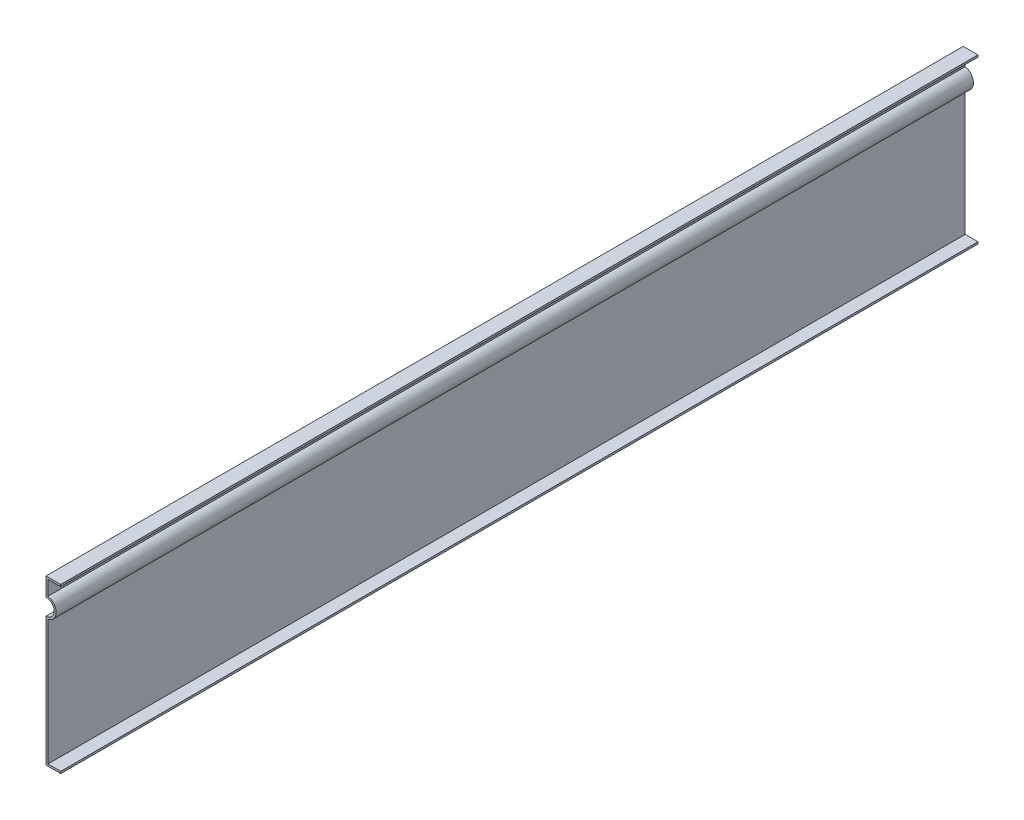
ISO-10303-21;
HEADER;
FILE_DESCRIPTION(('STEP AP214'),'2;1');
FILE_NAME('part.step','',(''),(''),'','','');
FILE_SCHEMA(('AUTOMOTIVE_DESIGN { 1 0 10303 214 1 1 1 1 }'));
ENDSEC;
DATA;
#1=APPLICATION_CONTEXT('core data for automotive mechanical design processes');
#2=APPLICATION_PROTOCOL_DEFINITION('international standard','automotive_design',2000,#1);
#3=PRODUCT_CONTEXT('',#1,'mechanical');
#4=PRODUCT('Part','Part','',(#3));
#5=PRODUCT_RELATED_PRODUCT_CATEGORY('part','',(#4));
#6=PRODUCT_DEFINITION_FORMATION('','',#4);
#7=PRODUCT_DEFINITION_CONTEXT('part definition',#1,'design');
#8=PRODUCT_DEFINITION('design','',#6,#7);
#9=PRODUCT_DEFINITION_SHAPE('','',#8);
#10=(LENGTH_UNIT() NAMED_UNIT(*) SI_UNIT(.MILLI.,.METRE.));
#11=(NAMED_UNIT(*) PLANE_ANGLE_UNIT() SI_UNIT($,.RADIAN.));
#12=(NAMED_UNIT(*) SI_UNIT($,.STERADIAN.) SOLID_ANGLE_UNIT());
#13=UNCERTAINTY_MEASURE_WITH_UNIT(LENGTH_MEASURE(1.E-05),#10,'distance_accuracy_value','');
#14=(GEOMETRIC_REPRESENTATION_CONTEXT(3) GLOBAL_UNCERTAINTY_ASSIGNED_CONTEXT((#13)) GLOBAL_UNIT_ASSIGNED_CONTEXT((#10,
#11,#12)) REPRESENTATION_CONTEXT('',''));
#15=CARTESIAN_POINT('',(0.,0.,0.));
#16=DIRECTION('',(0.,0.,1.));
#17=DIRECTION('',(1.,0.,0.));
#18=AXIS2_PLACEMENT_3D('',#15,#16,#17);
#19=CARTESIAN_POINT('',(0.,-1.214,560.));
#20=DIRECTION('',(-1.,0.,0.));
#21=DIRECTION('',(0.,0.,1.));
#22=AXIS2_PLACEMENT_3D('',#19,#20,#21);
#23=PLANE('',#22);
#24=DIRECTION('',(0.,1.,0.));
#25=VECTOR('',#24,1.);
#26=CARTESIAN_POINT('',(0.,-1.214,0.));
#27=LINE('',#26,#25);
#28=CARTESIAN_POINT('',(0.,-1.214,0.));
#29=VERTEX_POINT('',#28);
#30=CARTESIAN_POINT('',(0.,0.,0.));
#31=VERTEX_POINT('',#30);
#32=EDGE_CURVE('E150',#29,#31,#27,.T.);
#33=ORIENTED_EDGE('',*,*,#32,.T.);
#34=DIRECTION('',(0.,0.,-1.));
#35=VECTOR('',#34,1.);
#36=CARTESIAN_POINT('',(0.,0.,560.));
#37=LINE('',#36,#35);
#38=CARTESIAN_POINT('',(0.,0.,560.));
#39=VERTEX_POINT('',#38);
#40=EDGE_CURVE('E11',#39,#31,#37,.T.);
#41=ORIENTED_EDGE('',*,*,#40,.F.);
#42=DIRECTION('',(0.,1.,0.));
#43=VECTOR('',#42,1.);
#44=CARTESIAN_POINT('',(0.,-1.214,560.));
#45=LINE('',#44,#43);
#46=CARTESIAN_POINT('',(0.,-1.214,560.));
#47=VERTEX_POINT('',#46);
#48=EDGE_CURVE('E172',#47,#39,#45,.T.);
#49=ORIENTED_EDGE('',*,*,#48,.F.);
#50=DIRECTION('',(0.,0.,-1.));
#51=VECTOR('',#50,1.);
#52=CARTESIAN_POINT('',(0.,-1.214,560.));
#53=LINE('',#52,#51);
#54=EDGE_CURVE('E146',#47,#29,#53,.T.);
#55=ORIENTED_EDGE('',*,*,#54,.T.);
#56=EDGE_LOOP('',(#33,#41,#49,#55));
#57=FACE_BOUND('',#56,.T.);
#58=ADVANCED_FACE('F30',(#57),#23,.F.);
#59=CARTESIAN_POINT('',(0.,0.,560.));
#60=DIRECTION('',(0.,-1.,0.));
#61=DIRECTION('',(1.,0.,0.));
#62=AXIS2_PLACEMENT_3D('',#59,#60,#61);
#63=PLANE('',#62);
#64=DIRECTION('',(-1.,0.,0.));
#65=VECTOR('',#64,1.);
#66=CARTESIAN_POINT('',(0.,0.,0.));
#67=LINE('',#66,#65);
#68=CARTESIAN_POINT('',(-7.78599999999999,0.,0.));
#69=VERTEX_POINT('',#68);
#70=EDGE_CURVE('E153',#31,#69,#67,.T.);
#71=ORIENTED_EDGE('',*,*,#70,.T.);
#72=DIRECTION('',(0.,0.,-1.));
#73=VECTOR('',#72,1.);
#74=CARTESIAN_POINT('',(-7.78599999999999,0.,560.));
#75=LINE('',#74,#73);
#76=CARTESIAN_POINT('',(-7.78599999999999,0.,560.));
#77=VERTEX_POINT('',#76);
#78=EDGE_CURVE('E38',#77,#69,#75,.T.);
#79=ORIENTED_EDGE('',*,*,#78,.F.);
#80=DIRECTION('',(-1.,0.,0.));
#81=VECTOR('',#80,1.);
#82=CARTESIAN_POINT('',(0.,0.,560.));
#83=LINE('',#82,#81);
#84=EDGE_CURVE('E101',#39,#77,#83,.T.);
#85=ORIENTED_EDGE('',*,*,#84,.F.);
#86=ORIENTED_EDGE('',*,*,#40,.T.);
#87=EDGE_LOOP('',(#71,#79,#85,#86));
#88=FACE_BOUND('',#87,.T.);
#89=ADVANCED_FACE('F250',(#88),#63,.F.);
#90=CARTESIAN_POINT('',(-7.78599999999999,0.,560.));
#91=DIRECTION('',(-1.,0.,0.));
#92=DIRECTION('',(0.,-1.,0.));
#93=AXIS2_PLACEMENT_3D('',#90,#91,#92);
#94=PLANE('',#93);
#95=DIRECTION('',(0.,1.,0.));
#96=VECTOR('',#95,1.);
#97=CARTESIAN_POINT('',(-7.78599999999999,0.,0.));
#98=LINE('',#97,#96);
#99=CARTESIAN_POINT('',(-7.78599999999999,76.477740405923,0.));
#100=VERTEX_POINT('',#99);
#101=EDGE_CURVE('E155',#69,#100,#98,.T.);
#102=ORIENTED_EDGE('',*,*,#101,.T.);
#103=DIRECTION('',(0.,0.,-1.));
#104=VECTOR('',#103,1.);
#105=CARTESIAN_POINT('',(-7.78599999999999,76.477740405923,560.));
#106=LINE('',#105,#104);
#107=CARTESIAN_POINT('',(-7.78599999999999,76.477740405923,560.));
#108=VERTEX_POINT('',#107);
#109=EDGE_CURVE('E191',#108,#100,#106,.T.);
#110=ORIENTED_EDGE('',*,*,#109,.F.);
#111=DIRECTION('',(0.,1.,0.));
#112=VECTOR('',#111,1.);
#113=CARTESIAN_POINT('',(-7.78599999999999,0.,560.));
#114=LINE('',#113,#112);
#115=EDGE_CURVE('E199',#77,#108,#114,.T.);
#116=ORIENTED_EDGE('',*,*,#115,.F.);
#117=ORIENTED_EDGE('',*,*,#78,.T.);
#118=EDGE_LOOP('',(#102,#110,#116,#117));
#119=FACE_BOUND('',#118,.T.);
#120=ADVANCED_FACE('F197',(#119),#94,.F.);
#121=CARTESIAN_POINT('',(-9.,82.572,560.));
#122=DIRECTION('',(0.,0.,-1.));
#123=DIRECTION('',(-1.,0.,0.));
#124=AXIS2_PLACEMENT_3D('',#121,#122,#123);
#125=CYLINDRICAL_SURFACE('',#124,6.21399999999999);
#126=CARTESIAN_POINT('',(-9.,82.572,0.));
#127=DIRECTION('',(0.,0.,1.));
#128=DIRECTION('',(-1.,0.,0.));
#129=AXIS2_PLACEMENT_3D('',#126,#127,#128);
#130=CIRCLE('',#129,6.21399999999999);
#131=CARTESIAN_POINT('',(-7.78599999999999,88.666259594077,0.));
#132=VERTEX_POINT('',#131);
#133=EDGE_CURVE('E157',#100,#132,#130,.T.);
#134=ORIENTED_EDGE('',*,*,#133,.T.);
#135=DIRECTION('',(0.,0.,-1.));
#136=VECTOR('',#135,1.);
#137=CARTESIAN_POINT('',(-7.78599999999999,88.666259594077,560.));
#138=LINE('',#137,#136);
#139=CARTESIAN_POINT('',(-7.78599999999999,88.666259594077,560.));
#140=VERTEX_POINT('',#139);
#141=EDGE_CURVE('E188',#140,#132,#138,.T.);
#142=ORIENTED_EDGE('',*,*,#141,.F.);
#143=CARTESIAN_POINT('',(-9.,82.572,560.));
#144=DIRECTION('',(0.,0.,1.));
#145=DIRECTION('',(-1.,0.,0.));
#146=AXIS2_PLACEMENT_3D('',#143,#144,#145);
#147=CIRCLE('',#146,6.21399999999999);
#148=EDGE_CURVE('E217',#108,#140,#147,.T.);
#149=ORIENTED_EDGE('',*,*,#148,.F.);
#150=ORIENTED_EDGE('',*,*,#109,.T.);
#151=EDGE_LOOP('',(#134,#142,#149,#150));
#152=FACE_BOUND('',#151,.T.);
#153=ADVANCED_FACE('F208',(#152),#125,.T.);
#154=CARTESIAN_POINT('',(-7.78599999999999,88.666259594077,560.));
#155=DIRECTION('',(-1.,0.,0.));
#156=DIRECTION('',(0.,-1.,0.));
#157=AXIS2_PLACEMENT_3D('',#154,#155,#156);
#158=PLANE('',#157);
#159=DIRECTION('',(0.,1.,0.));
#160=VECTOR('',#159,1.);
#161=CARTESIAN_POINT('',(-7.78599999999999,88.666259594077,0.));
#162=LINE('',#161,#160);
#163=CARTESIAN_POINT('',(-7.78599999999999,97.572,0.));
#164=VERTEX_POINT('',#163);
#165=EDGE_CURVE('E159',#132,#164,#162,.T.);
#166=ORIENTED_EDGE('',*,*,#165,.T.);
#167=DIRECTION('',(0.,0.,-1.));
#168=VECTOR('',#167,1.);
#169=CARTESIAN_POINT('',(-7.78599999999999,97.572,560.));
#170=LINE('',#169,#168);
#171=CARTESIAN_POINT('',(-7.78599999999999,97.572,560.));
#172=VERTEX_POINT('',#171);
#173=EDGE_CURVE('E185',#172,#164,#170,.T.);
#174=ORIENTED_EDGE('',*,*,#173,.F.);
#175=DIRECTION('',(0.,1.,0.));
#176=VECTOR('',#175,1.);
#177=CARTESIAN_POINT('',(-7.78599999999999,88.666259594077,560.));
#178=LINE('',#177,#176);
#179=EDGE_CURVE('E214',#140,#172,#178,.T.);
#180=ORIENTED_EDGE('',*,*,#179,.F.);
#181=ORIENTED_EDGE('',*,*,#141,.T.);
#182=EDGE_LOOP('',(#166,#174,#180,#181));
#183=FACE_BOUND('',#182,.T.);
#184=ADVANCED_FACE('F212',(#183),#158,.F.);
#185=CARTESIAN_POINT('',(-7.78599999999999,97.572,560.));
#186=DIRECTION('',(0.,1.,0.));
#187=DIRECTION('',(0.,0.,1.));
#188=AXIS2_PLACEMENT_3D('',#185,#186,#187);
#189=PLANE('',#188);
#190=DIRECTION('',(1.,0.,0.));
#191=VECTOR('',#190,1.);
#192=CARTESIAN_POINT('',(-7.78599999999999,97.572,0.));
#193=LINE('',#192,#191);
#194=CARTESIAN_POINT('',(0.,97.572,0.));
#195=VERTEX_POINT('',#194);
#196=EDGE_CURVE('E161',#164,#195,#193,.T.);
#197=ORIENTED_EDGE('',*,*,#196,.T.);
#198=DIRECTION('',(0.,0.,-1.));
#199=VECTOR('',#198,1.);
#200=CARTESIAN_POINT('',(0.,97.572,560.));
#201=LINE('',#200,#199);
#202=CARTESIAN_POINT('',(0.,97.572,560.));
#203=VERTEX_POINT('',#202);
#204=EDGE_CURVE('E182',#203,#195,#201,.T.);
#205=ORIENTED_EDGE('',*,*,#204,.F.);
#206=DIRECTION('',(1.,0.,0.));
#207=VECTOR('',#206,1.);
#208=CARTESIAN_POINT('',(-7.78599999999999,97.572,560.));
#209=LINE('',#208,#207);
#210=EDGE_CURVE('E216',#172,#203,#209,.T.);
#211=ORIENTED_EDGE('',*,*,#210,.F.);
#212=ORIENTED_EDGE('',*,*,#173,.T.);
#213=EDGE_LOOP('',(#197,#205,#211,#212));
#214=FACE_BOUND('',#213,.T.);
#215=ADVANCED_FACE('F263',(#214),#189,.F.);
#216=CARTESIAN_POINT('',(0.,97.572,560.));
#217=DIRECTION('',(-1.,0.,0.));
#218=DIRECTION('',(0.,0.,1.));
#219=AXIS2_PLACEMENT_3D('',#216,#217,#218);
#220=PLANE('',#219);
#221=DIRECTION('',(0.,1.,0.));
#222=VECTOR('',#221,1.);
#223=CARTESIAN_POINT('',(0.,97.572,0.));
#224=LINE('',#223,#222);
#225=CARTESIAN_POINT('',(0.,98.786,0.));
#226=VERTEX_POINT('',#225);
#227=EDGE_CURVE('E163',#195,#226,#224,.T.);
#228=ORIENTED_EDGE('',*,*,#227,.T.);
#229=DIRECTION('',(0.,0.,-1.));
#230=VECTOR('',#229,1.);
#231=CARTESIAN_POINT('',(0.,98.786,560.));
#232=LINE('',#231,#230);
#233=CARTESIAN_POINT('',(0.,98.786,560.));
#234=VERTEX_POINT('',#233);
#235=EDGE_CURVE('E179',#234,#226,#232,.T.);
#236=ORIENTED_EDGE('',*,*,#235,.F.);
#237=DIRECTION('',(0.,1.,0.));
#238=VECTOR('',#237,1.);
#239=CARTESIAN_POINT('',(0.,97.572,560.));
#240=LINE('',#239,#238);
#241=EDGE_CURVE('E219',#203,#234,#240,.T.);
#242=ORIENTED_EDGE('',*,*,#241,.F.);
#243=ORIENTED_EDGE('',*,*,#204,.T.);
#244=EDGE_LOOP('',(#228,#236,#242,#243));
#245=FACE_BOUND('',#244,.T.);
#246=ADVANCED_FACE('F266',(#245),#220,.F.);
#247=CARTESIAN_POINT('',(0.,98.786,560.));
#248=DIRECTION('',(0.,-1.,0.));
#249=DIRECTION('',(0.,0.,-1.));
#250=AXIS2_PLACEMENT_3D('',#247,#248,#249);
#251=PLANE('',#250);
#252=DIRECTION('',(-1.,0.,0.));
#253=VECTOR('',#252,1.);
#254=CARTESIAN_POINT('',(0.,98.786,0.));
#255=LINE('',#254,#253);
#256=CARTESIAN_POINT('',(-9.,98.786,0.));
#257=VERTEX_POINT('',#256);
#258=EDGE_CURVE('E165',#226,#257,#255,.T.);
#259=ORIENTED_EDGE('',*,*,#258,.T.);
#260=DIRECTION('',(0.,0.,-1.));
#261=VECTOR('',#260,1.);
#262=CARTESIAN_POINT('',(-9.,98.786,560.));
#263=LINE('',#262,#261);
#264=CARTESIAN_POINT('',(-9.,98.786,560.));
#265=VERTEX_POINT('',#264);
#266=EDGE_CURVE('E176',#265,#257,#263,.T.);
#267=ORIENTED_EDGE('',*,*,#266,.F.);
#268=DIRECTION('',(-1.,0.,0.));
#269=VECTOR('',#268,1.);
#270=CARTESIAN_POINT('',(0.,98.786,560.));
#271=LINE('',#270,#269);
#272=EDGE_CURVE('E225',#234,#265,#271,.T.);
#273=ORIENTED_EDGE('',*,*,#272,.F.);
#274=ORIENTED_EDGE('',*,*,#235,.T.);
#275=EDGE_LOOP('',(#259,#267,#273,#274));
#276=FACE_BOUND('',#275,.T.);
#277=ADVANCED_FACE('F231',(#276),#251,.F.);
#278=CARTESIAN_POINT('',(-9.,98.786,560.));
#279=DIRECTION('',(1.,0.,0.));
#280=DIRECTION('',(0.,1.,0.));
#281=AXIS2_PLACEMENT_3D('',#278,#279,#280);
#282=PLANE('',#281);
#283=DIRECTION('',(0.,-1.,0.));
#284=VECTOR('',#283,1.);
#285=CARTESIAN_POINT('',(-9.,98.786,0.));
#286=LINE('',#285,#284);
#287=CARTESIAN_POINT('',(-9.,87.572,0.));
#288=VERTEX_POINT('',#287);
#289=EDGE_CURVE('E167',#257,#288,#286,.T.);
#290=ORIENTED_EDGE('',*,*,#289,.T.);
#291=DIRECTION('',(0.,0.,-1.));
#292=VECTOR('',#291,1.);
#293=CARTESIAN_POINT('',(-9.,87.572,560.));
#294=LINE('',#293,#292);
#295=CARTESIAN_POINT('',(-9.,87.572,560.));
#296=VERTEX_POINT('',#295);
#297=EDGE_CURVE('E141',#296,#288,#294,.T.);
#298=ORIENTED_EDGE('',*,*,#297,.F.);
#299=DIRECTION('',(0.,-1.,0.));
#300=VECTOR('',#299,1.);
#301=CARTESIAN_POINT('',(-9.,98.786,560.));
#302=LINE('',#301,#300);
#303=EDGE_CURVE('E132',#265,#296,#302,.T.);
#304=ORIENTED_EDGE('',*,*,#303,.F.);
#305=ORIENTED_EDGE('',*,*,#266,.T.);
#306=EDGE_LOOP('',(#290,#298,#304,#305));
#307=FACE_BOUND('',#306,.T.);
#308=ADVANCED_FACE('F235',(#307),#282,.F.);
#309=CARTESIAN_POINT('',(-9.,82.572,560.));
#310=DIRECTION('',(0.,0.,-1.));
#311=DIRECTION('',(-1.,0.,0.));
#312=AXIS2_PLACEMENT_3D('',#309,#310,#311);
#313=CYLINDRICAL_SURFACE('',#312,5.);
#314=CARTESIAN_POINT('',(-9.,82.572,0.));
#315=DIRECTION('',(0.,0.,-1.));
#316=DIRECTION('',(-1.,0.,0.));
#317=AXIS2_PLACEMENT_3D('',#314,#315,#316);
#318=CIRCLE('',#317,5.);
#319=CARTESIAN_POINT('',(-9.,77.572,0.));
#320=VERTEX_POINT('',#319);
#321=EDGE_CURVE('E140',#288,#320,#318,.T.);
#322=ORIENTED_EDGE('',*,*,#321,.T.);
#323=DIRECTION('',(0.,0.,-1.));
#324=VECTOR('',#323,1.);
#325=CARTESIAN_POINT('',(-9.,77.572,560.));
#326=LINE('',#325,#324);
#327=CARTESIAN_POINT('',(-9.,77.572,560.));
#328=VERTEX_POINT('',#327);
#329=EDGE_CURVE('E137',#328,#320,#326,.T.);
#330=ORIENTED_EDGE('',*,*,#329,.F.);
#331=CARTESIAN_POINT('',(-9.,82.572,560.));
#332=DIRECTION('',(0.,0.,-1.));
#333=DIRECTION('',(-1.,0.,0.));
#334=AXIS2_PLACEMENT_3D('',#331,#332,#333);
#335=CIRCLE('',#334,5.);
#336=EDGE_CURVE('E126',#296,#328,#335,.T.);
#337=ORIENTED_EDGE('',*,*,#336,.F.);
#338=ORIENTED_EDGE('',*,*,#297,.T.);
#339=EDGE_LOOP('',(#322,#330,#337,#338));
#340=FACE_BOUND('',#339,.T.);
#341=ADVANCED_FACE('F138',(#340),#313,.F.);
#342=CARTESIAN_POINT('',(-9.,77.572,560.));
#343=DIRECTION('',(1.,0.,0.));
#344=DIRECTION('',(0.,1.,0.));
#345=AXIS2_PLACEMENT_3D('',#342,#343,#344);
#346=PLANE('',#345);
#347=DIRECTION('',(0.,-1.,0.));
#348=VECTOR('',#347,1.);
#349=CARTESIAN_POINT('',(-9.,77.572,0.));
#350=LINE('',#349,#348);
#351=CARTESIAN_POINT('',(-8.99999999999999,-1.214,0.));
#352=VERTEX_POINT('',#351);
#353=EDGE_CURVE('E87',#320,#352,#350,.T.);
#354=ORIENTED_EDGE('',*,*,#353,.T.);
#355=DIRECTION('',(0.,0.,-1.));
#356=VECTOR('',#355,1.);
#357=CARTESIAN_POINT('',(-8.99999999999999,-1.214,560.));
#358=LINE('',#357,#356);
#359=CARTESIAN_POINT('',(-8.99999999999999,-1.214,560.));
#360=VERTEX_POINT('',#359);
#361=EDGE_CURVE('E142',#360,#352,#358,.T.);
#362=ORIENTED_EDGE('',*,*,#361,.F.);
#363=DIRECTION('',(0.,-1.,0.));
#364=VECTOR('',#363,1.);
#365=CARTESIAN_POINT('',(-9.,77.572,560.));
#366=LINE('',#365,#364);
#367=EDGE_CURVE('E130',#328,#360,#366,.T.);
#368=ORIENTED_EDGE('',*,*,#367,.F.);
#369=ORIENTED_EDGE('',*,*,#329,.T.);
#370=EDGE_LOOP('',(#354,#362,#368,#369));
#371=FACE_BOUND('',#370,.T.);
#372=ADVANCED_FACE('F144',(#371),#346,.F.);
#373=CARTESIAN_POINT('',(-8.99999999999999,-1.214,560.));
#374=DIRECTION('',(0.,1.,0.));
#375=DIRECTION('',(0.,0.,1.));
#376=AXIS2_PLACEMENT_3D('',#373,#374,#375);
#377=PLANE('',#376);
#378=DIRECTION('',(1.,0.,0.));
#379=VECTOR('',#378,1.);
#380=CARTESIAN_POINT('',(-8.99999999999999,-1.214,0.));
#381=LINE('',#380,#379);
#382=EDGE_CURVE('E93',#352,#29,#381,.T.);
#383=ORIENTED_EDGE('',*,*,#382,.T.);
#384=ORIENTED_EDGE('',*,*,#54,.F.);
#385=DIRECTION('',(1.,0.,0.));
#386=VECTOR('',#385,1.);
#387=CARTESIAN_POINT('',(-8.99999999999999,-1.214,560.));
#388=LINE('',#387,#386);
#389=EDGE_CURVE('E46',#360,#47,#388,.T.);
#390=ORIENTED_EDGE('',*,*,#389,.F.);
#391=ORIENTED_EDGE('',*,*,#361,.T.);
#392=EDGE_LOOP('',(#383,#384,#390,#391));
#393=FACE_BOUND('',#392,.T.);
#394=ADVANCED_FACE('F239',(#393),#377,.F.);
#395=CARTESIAN_POINT('',(-9.,82.572,560.));
#396=DIRECTION('',(0.,0.,-1.));
#397=DIRECTION('',(-1.,0.,0.));
#398=AXIS2_PLACEMENT_3D('',#395,#396,#397);
#399=PLANE('',#398);
#400=ORIENTED_EDGE('',*,*,#48,.T.);
#401=ORIENTED_EDGE('',*,*,#84,.T.);
#402=ORIENTED_EDGE('',*,*,#115,.T.);
#403=ORIENTED_EDGE('',*,*,#148,.T.);
#404=ORIENTED_EDGE('',*,*,#179,.T.);
#405=ORIENTED_EDGE('',*,*,#210,.T.);
#406=ORIENTED_EDGE('',*,*,#241,.T.);
#407=ORIENTED_EDGE('',*,*,#272,.T.);
#408=ORIENTED_EDGE('',*,*,#303,.T.);
#409=ORIENTED_EDGE('',*,*,#336,.T.);
#410=ORIENTED_EDGE('',*,*,#367,.T.);
#411=ORIENTED_EDGE('',*,*,#389,.T.);
#412=EDGE_LOOP('',(#400,#401,#402,#403,#404,#405,#406,#407,#408,#409,#410,#411));
#413=FACE_BOUND('',#412,.T.);
#414=ADVANCED_FACE('F128',(#413),#399,.F.);
#415=CARTESIAN_POINT('',(-9.,82.572,0.));
#416=DIRECTION('',(0.,0.,-1.));
#417=DIRECTION('',(-1.,0.,0.));
#418=AXIS2_PLACEMENT_3D('',#415,#416,#417);
#419=PLANE('',#418);
#420=ORIENTED_EDGE('',*,*,#32,.F.);
#421=ORIENTED_EDGE('',*,*,#382,.F.);
#422=ORIENTED_EDGE('',*,*,#353,.F.);
#423=ORIENTED_EDGE('',*,*,#321,.F.);
#424=ORIENTED_EDGE('',*,*,#289,.F.);
#425=ORIENTED_EDGE('',*,*,#258,.F.);
#426=ORIENTED_EDGE('',*,*,#227,.F.);
#427=ORIENTED_EDGE('',*,*,#196,.F.);
#428=ORIENTED_EDGE('',*,*,#165,.F.);
#429=ORIENTED_EDGE('',*,*,#133,.F.);
#430=ORIENTED_EDGE('',*,*,#101,.F.);
#431=ORIENTED_EDGE('',*,*,#70,.F.);
#432=EDGE_LOOP('',(#420,#421,#422,#423,#424,#425,#426,#427,#428,#429,#430,#431));
#433=FACE_BOUND('',#432,.T.);
#434=ADVANCED_FACE('F203',(#433),#419,.T.);
#435=CLOSED_SHELL('',(#58,#89,#120,#153,#184,#215,#246,#277,#308,#341,#372,#394,#414,#434));
#436=MANIFOLD_SOLID_BREP('B2',#435);
#437=ADVANCED_BREP_SHAPE_REPRESENTATION('',(#18,#436),#14);
#438=SHAPE_DEFINITION_REPRESENTATION(#9,#437);
ENDSEC;
END-ISO-10303-21;
